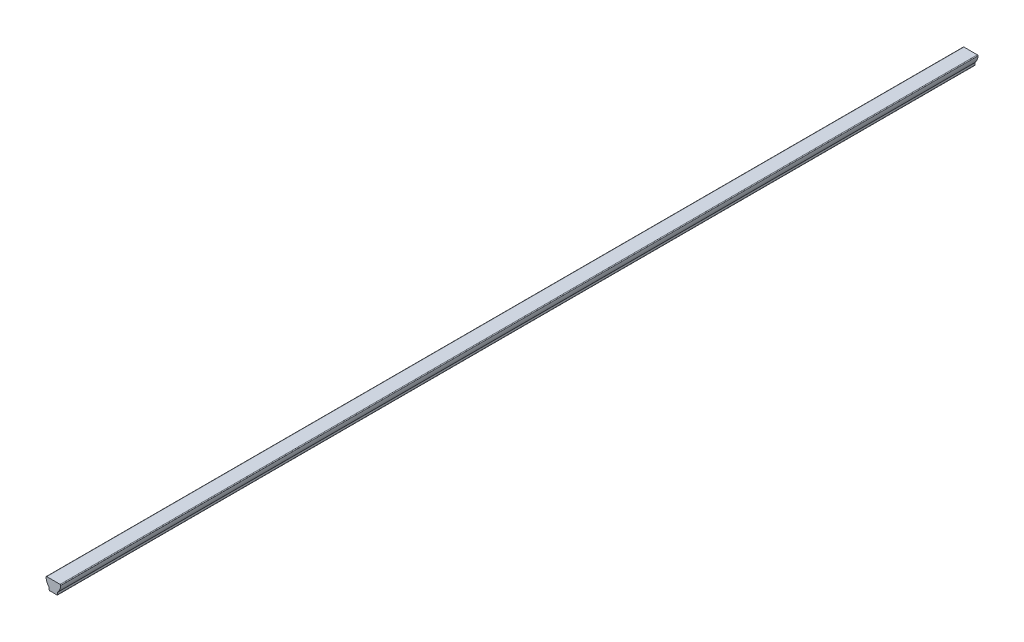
ISO-10303-21;
HEADER;
FILE_DESCRIPTION(('STEP AP214'),'2;1');
FILE_NAME('part.step','',(''),(''),'','','');
FILE_SCHEMA(('AUTOMOTIVE_DESIGN { 1 0 10303 214 1 1 1 1 }'));
ENDSEC;
DATA;
#1=APPLICATION_CONTEXT('core data for automotive mechanical design processes');
#2=APPLICATION_PROTOCOL_DEFINITION('international standard','automotive_design',2000,#1);
#3=PRODUCT_CONTEXT('',#1,'mechanical');
#4=PRODUCT('Part','Part','',(#3));
#5=PRODUCT_RELATED_PRODUCT_CATEGORY('part','',(#4));
#6=PRODUCT_DEFINITION_FORMATION('','',#4);
#7=PRODUCT_DEFINITION_CONTEXT('part definition',#1,'design');
#8=PRODUCT_DEFINITION('design','',#6,#7);
#9=PRODUCT_DEFINITION_SHAPE('','',#8);
#10=(LENGTH_UNIT() NAMED_UNIT(*) SI_UNIT(.MILLI.,.METRE.));
#11=(NAMED_UNIT(*) PLANE_ANGLE_UNIT() SI_UNIT($,.RADIAN.));
#12=(NAMED_UNIT(*) SI_UNIT($,.STERADIAN.) SOLID_ANGLE_UNIT());
#13=UNCERTAINTY_MEASURE_WITH_UNIT(LENGTH_MEASURE(1.E-05),#10,'distance_accuracy_value','');
#14=(GEOMETRIC_REPRESENTATION_CONTEXT(3) GLOBAL_UNCERTAINTY_ASSIGNED_CONTEXT((#13)) GLOBAL_UNIT_ASSIGNED_CONTEXT((#10,
#11,#12)) REPRESENTATION_CONTEXT('',''));
#15=CARTESIAN_POINT('',(0.,0.,0.));
#16=DIRECTION('',(0.,0.,1.));
#17=DIRECTION('',(1.,0.,0.));
#18=AXIS2_PLACEMENT_3D('',#15,#16,#17);
#19=CARTESIAN_POINT('',(-3.70910590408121,5.588,508.));
#20=DIRECTION('',(0.,0.,-1.));
#21=DIRECTION('',(-1.,0.,0.));
#22=AXIS2_PLACEMENT_3D('',#19,#20,#21);
#23=CYLINDRICAL_SURFACE('',#22,0.381);
#24=CARTESIAN_POINT('',(-3.70910590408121,5.588,0.));
#25=DIRECTION('',(0.,0.,1.));
#26=DIRECTION('',(-1.,0.,0.));
#27=AXIS2_PLACEMENT_3D('',#24,#25,#26);
#28=CIRCLE('',#27,0.381);
#29=CARTESIAN_POINT('',(-3.70910590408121,5.969,0.));
#30=VERTEX_POINT('',#29);
#31=CARTESIAN_POINT('',(-4.08935148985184,5.56403555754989,0.));
#32=VERTEX_POINT('',#31);
#33=EDGE_CURVE('E106',#30,#32,#28,.T.);
#34=ORIENTED_EDGE('',*,*,#33,.T.);
#35=DIRECTION('',(0.,0.,-1.));
#36=VECTOR('',#35,1.);
#37=CARTESIAN_POINT('',(-4.08935148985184,5.56403555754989,508.));
#38=LINE('',#37,#36);
#39=CARTESIAN_POINT('',(-4.08935148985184,5.56403555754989,508.));
#40=VERTEX_POINT('',#39);
#41=EDGE_CURVE('E9',#40,#32,#38,.T.);
#42=ORIENTED_EDGE('',*,*,#41,.F.);
#43=CARTESIAN_POINT('',(-3.70910590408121,5.588,508.));
#44=DIRECTION('',(0.,0.,1.));
#45=DIRECTION('',(-1.,0.,0.));
#46=AXIS2_PLACEMENT_3D('',#43,#44,#45);
#47=CIRCLE('',#46,0.381);
#48=CARTESIAN_POINT('',(-3.70910590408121,5.969,508.));
#49=VERTEX_POINT('',#48);
#50=EDGE_CURVE('E141',#49,#40,#47,.T.);
#51=ORIENTED_EDGE('',*,*,#50,.F.);
#52=DIRECTION('',(0.,0.,-1.));
#53=VECTOR('',#52,1.);
#54=CARTESIAN_POINT('',(-3.70910590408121,5.969,508.));
#55=LINE('',#54,#53);
#56=EDGE_CURVE('E119',#49,#30,#55,.T.);
#57=ORIENTED_EDGE('',*,*,#56,.T.);
#58=EDGE_LOOP('',(#34,#42,#51,#57));
#59=FACE_BOUND('',#58,.T.);
#60=ADVANCED_FACE('F14',(#59),#23,.T.);
#61=CARTESIAN_POINT('',(2.33624935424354,5.969,508.));
#62=DIRECTION('',(0.,0.,-1.));
#63=DIRECTION('',(-1.,0.,0.));
#64=AXIS2_PLACEMENT_3D('',#61,#62,#63);
#65=CYLINDRICAL_SURFACE('',#64,6.43834935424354);
#66=CARTESIAN_POINT('',(2.33624935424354,5.969,0.));
#67=DIRECTION('',(0.,0.,1.));
#68=DIRECTION('',(1.,0.,0.));
#69=AXIS2_PLACEMENT_3D('',#66,#67,#68);
#70=CIRCLE('',#69,6.43834935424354);
#71=CARTESIAN_POINT('',(-2.47739463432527,1.69335104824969,0.));
#72=VERTEX_POINT('',#71);
#73=EDGE_CURVE('E102',#32,#72,#70,.T.);
#74=ORIENTED_EDGE('',*,*,#73,.T.);
#75=DIRECTION('',(0.,0.,-1.));
#76=VECTOR('',#75,1.);
#77=CARTESIAN_POINT('',(-2.47739463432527,1.69335104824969,508.));
#78=LINE('',#77,#76);
#79=CARTESIAN_POINT('',(-2.47739463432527,1.69335104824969,508.));
#80=VERTEX_POINT('',#79);
#81=EDGE_CURVE('E21',#80,#72,#78,.T.);
#82=ORIENTED_EDGE('',*,*,#81,.F.);
#83=CARTESIAN_POINT('',(2.33624935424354,5.969,508.));
#84=DIRECTION('',(0.,0.,1.));
#85=DIRECTION('',(1.,0.,0.));
#86=AXIS2_PLACEMENT_3D('',#83,#84,#85);
#87=CIRCLE('',#86,6.43834935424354);
#88=EDGE_CURVE('E115',#40,#80,#87,.T.);
#89=ORIENTED_EDGE('',*,*,#88,.F.);
#90=ORIENTED_EDGE('',*,*,#41,.T.);
#91=EDGE_LOOP('',(#74,#82,#89,#90));
#92=FACE_BOUND('',#91,.T.);
#93=ADVANCED_FACE('F114',(#92),#65,.T.);
#94=CARTESIAN_POINT('',(-2.76225,1.44033243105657,508.));
#95=DIRECTION('',(0.,0.,-1.));
#96=DIRECTION('',(-1.,0.,0.));
#97=AXIS2_PLACEMENT_3D('',#94,#95,#96);
#98=CYLINDRICAL_SURFACE('',#97,0.381);
#99=CARTESIAN_POINT('',(-2.76225,1.44033243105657,0.));
#100=DIRECTION('',(0.,0.,-1.));
#101=DIRECTION('',(-1.,0.,0.));
#102=AXIS2_PLACEMENT_3D('',#99,#100,#101);
#103=CIRCLE('',#102,0.381);
#104=CARTESIAN_POINT('',(-2.38125,1.44033243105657,0.));
#105=VERTEX_POINT('',#104);
#106=EDGE_CURVE('E108',#72,#105,#103,.T.);
#107=ORIENTED_EDGE('',*,*,#106,.T.);
#108=DIRECTION('',(0.,0.,-1.));
#109=VECTOR('',#108,1.);
#110=CARTESIAN_POINT('',(-2.38125,1.44033243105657,508.));
#111=LINE('',#110,#109);
#112=CARTESIAN_POINT('',(-2.38125,1.44033243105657,508.));
#113=VERTEX_POINT('',#112);
#114=EDGE_CURVE('E187',#113,#105,#111,.T.);
#115=ORIENTED_EDGE('',*,*,#114,.F.);
#116=CARTESIAN_POINT('',(-2.76225,1.44033243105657,508.));
#117=DIRECTION('',(0.,0.,-1.));
#118=DIRECTION('',(-1.,0.,0.));
#119=AXIS2_PLACEMENT_3D('',#116,#117,#118);
#120=CIRCLE('',#119,0.381);
#121=EDGE_CURVE('E144',#80,#113,#120,.T.);
#122=ORIENTED_EDGE('',*,*,#121,.F.);
#123=ORIENTED_EDGE('',*,*,#81,.T.);
#124=EDGE_LOOP('',(#107,#115,#122,#123));
#125=FACE_BOUND('',#124,.T.);
#126=ADVANCED_FACE('F191',(#125),#98,.F.);
#127=CARTESIAN_POINT('',(-2.38125,0.381,508.));
#128=DIRECTION('',(1.,0.,0.));
#129=DIRECTION('',(0.,1.,0.));
#130=AXIS2_PLACEMENT_3D('',#127,#128,#129);
#131=PLANE('',#130);
#132=DIRECTION('',(0.,-1.,0.));
#133=VECTOR('',#132,1.);
#134=CARTESIAN_POINT('',(-2.38125,0.381,0.));
#135=LINE('',#134,#133);
#136=CARTESIAN_POINT('',(-2.38125,0.381,0.));
#137=VERTEX_POINT('',#136);
#138=EDGE_CURVE('E123',#105,#137,#135,.T.);
#139=ORIENTED_EDGE('',*,*,#138,.T.);
#140=DIRECTION('',(0.,0.,-1.));
#141=VECTOR('',#140,1.);
#142=CARTESIAN_POINT('',(-2.38125,0.381,508.));
#143=LINE('',#142,#141);
#144=CARTESIAN_POINT('',(-2.38125,0.381,508.));
#145=VERTEX_POINT('',#144);
#146=EDGE_CURVE('E184',#145,#137,#143,.T.);
#147=ORIENTED_EDGE('',*,*,#146,.F.);
#148=DIRECTION('',(0.,-1.,0.));
#149=VECTOR('',#148,1.);
#150=CARTESIAN_POINT('',(-2.38125,0.381,508.));
#151=LINE('',#150,#149);
#152=EDGE_CURVE('E146',#113,#145,#151,.T.);
#153=ORIENTED_EDGE('',*,*,#152,.F.);
#154=ORIENTED_EDGE('',*,*,#114,.T.);
#155=EDGE_LOOP('',(#139,#147,#153,#154));
#156=FACE_BOUND('',#155,.T.);
#157=ADVANCED_FACE('F199',(#156),#131,.F.);
#158=CARTESIAN_POINT('',(-2.00025,0.381,508.));
#159=DIRECTION('',(0.,0.,-1.));
#160=DIRECTION('',(-1.,0.,0.));
#161=AXIS2_PLACEMENT_3D('',#158,#159,#160);
#162=CYLINDRICAL_SURFACE('',#161,0.381);
#163=CARTESIAN_POINT('',(-2.00025,0.381,0.));
#164=DIRECTION('',(0.,0.,1.));
#165=DIRECTION('',(1.,0.,0.));
#166=AXIS2_PLACEMENT_3D('',#163,#164,#165);
#167=CIRCLE('',#166,0.381);
#168=CARTESIAN_POINT('',(-2.00025,0.,0.));
#169=VERTEX_POINT('',#168);
#170=EDGE_CURVE('E125',#137,#169,#167,.T.);
#171=ORIENTED_EDGE('',*,*,#170,.T.);
#172=DIRECTION('',(0.,0.,-1.));
#173=VECTOR('',#172,1.);
#174=CARTESIAN_POINT('',(-2.00025,0.,508.));
#175=LINE('',#174,#173);
#176=CARTESIAN_POINT('',(-2.00025,0.,508.));
#177=VERTEX_POINT('',#176);
#178=EDGE_CURVE('E181',#177,#169,#175,.T.);
#179=ORIENTED_EDGE('',*,*,#178,.F.);
#180=CARTESIAN_POINT('',(-2.00025,0.381,508.));
#181=DIRECTION('',(0.,0.,1.));
#182=DIRECTION('',(1.,0.,0.));
#183=AXIS2_PLACEMENT_3D('',#180,#181,#182);
#184=CIRCLE('',#183,0.381);
#185=EDGE_CURVE('E148',#145,#177,#184,.T.);
#186=ORIENTED_EDGE('',*,*,#185,.F.);
#187=ORIENTED_EDGE('',*,*,#146,.T.);
#188=EDGE_LOOP('',(#171,#179,#186,#187));
#189=FACE_BOUND('',#188,.T.);
#190=ADVANCED_FACE('F202',(#189),#162,.T.);
#191=CARTESIAN_POINT('',(-2.00025,0.,508.));
#192=DIRECTION('',(0.,1.,0.));
#193=DIRECTION('',(0.,0.,1.));
#194=AXIS2_PLACEMENT_3D('',#191,#192,#193);
#195=PLANE('',#194);
#196=DIRECTION('',(1.,0.,0.));
#197=VECTOR('',#196,1.);
#198=CARTESIAN_POINT('',(-2.00025,0.,0.));
#199=LINE('',#198,#197);
#200=CARTESIAN_POINT('',(2.00025,0.,0.));
#201=VERTEX_POINT('',#200);
#202=EDGE_CURVE('E127',#169,#201,#199,.T.);
#203=ORIENTED_EDGE('',*,*,#202,.T.);
#204=DIRECTION('',(0.,0.,-1.));
#205=VECTOR('',#204,1.);
#206=CARTESIAN_POINT('',(2.00025,0.,508.));
#207=LINE('',#206,#205);
#208=CARTESIAN_POINT('',(2.00025,0.,508.));
#209=VERTEX_POINT('',#208);
#210=EDGE_CURVE('E178',#209,#201,#207,.T.);
#211=ORIENTED_EDGE('',*,*,#210,.F.);
#212=DIRECTION('',(1.,0.,0.));
#213=VECTOR('',#212,1.);
#214=CARTESIAN_POINT('',(-2.00025,0.,508.));
#215=LINE('',#214,#213);
#216=EDGE_CURVE('E150',#177,#209,#215,.T.);
#217=ORIENTED_EDGE('',*,*,#216,.F.);
#218=ORIENTED_EDGE('',*,*,#178,.T.);
#219=EDGE_LOOP('',(#203,#211,#217,#218));
#220=FACE_BOUND('',#219,.T.);
#221=ADVANCED_FACE('F207',(#220),#195,.F.);
#222=CARTESIAN_POINT('',(2.00025,0.381,508.));
#223=DIRECTION('',(0.,0.,-1.));
#224=DIRECTION('',(-1.,0.,0.));
#225=AXIS2_PLACEMENT_3D('',#222,#223,#224);
#226=CYLINDRICAL_SURFACE('',#225,0.381);
#227=CARTESIAN_POINT('',(2.00025,0.381,0.));
#228=DIRECTION('',(0.,0.,1.));
#229=DIRECTION('',(1.,0.,0.));
#230=AXIS2_PLACEMENT_3D('',#227,#228,#229);
#231=CIRCLE('',#230,0.381);
#232=CARTESIAN_POINT('',(2.38125,0.381,0.));
#233=VERTEX_POINT('',#232);
#234=EDGE_CURVE('E129',#201,#233,#231,.T.);
#235=ORIENTED_EDGE('',*,*,#234,.T.);
#236=DIRECTION('',(0.,0.,-1.));
#237=VECTOR('',#236,1.);
#238=CARTESIAN_POINT('',(2.38125,0.381,508.));
#239=LINE('',#238,#237);
#240=CARTESIAN_POINT('',(2.38125,0.381,508.));
#241=VERTEX_POINT('',#240);
#242=EDGE_CURVE('E175',#241,#233,#239,.T.);
#243=ORIENTED_EDGE('',*,*,#242,.F.);
#244=CARTESIAN_POINT('',(2.00025,0.381,508.));
#245=DIRECTION('',(0.,0.,1.));
#246=DIRECTION('',(1.,0.,0.));
#247=AXIS2_PLACEMENT_3D('',#244,#245,#246);
#248=CIRCLE('',#247,0.381);
#249=EDGE_CURVE('E152',#209,#241,#248,.T.);
#250=ORIENTED_EDGE('',*,*,#249,.F.);
#251=ORIENTED_EDGE('',*,*,#210,.T.);
#252=EDGE_LOOP('',(#235,#243,#250,#251));
#253=FACE_BOUND('',#252,.T.);
#254=ADVANCED_FACE('F213',(#253),#226,.T.);
#255=CARTESIAN_POINT('',(2.38125,0.381,508.));
#256=DIRECTION('',(-1.,0.,0.));
#257=DIRECTION('',(0.,-1.,0.));
#258=AXIS2_PLACEMENT_3D('',#255,#256,#257);
#259=PLANE('',#258);
#260=DIRECTION('',(0.,1.,0.));
#261=VECTOR('',#260,1.);
#262=CARTESIAN_POINT('',(2.38125,0.381,0.));
#263=LINE('',#262,#261);
#264=CARTESIAN_POINT('',(2.38125,1.44033243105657,0.));
#265=VERTEX_POINT('',#264);
#266=EDGE_CURVE('E131',#233,#265,#263,.T.);
#267=ORIENTED_EDGE('',*,*,#266,.T.);
#268=DIRECTION('',(0.,0.,-1.));
#269=VECTOR('',#268,1.);
#270=CARTESIAN_POINT('',(2.38125,1.44033243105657,508.));
#271=LINE('',#270,#269);
#272=CARTESIAN_POINT('',(2.38125,1.44033243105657,508.));
#273=VERTEX_POINT('',#272);
#274=EDGE_CURVE('E172',#273,#265,#271,.T.);
#275=ORIENTED_EDGE('',*,*,#274,.F.);
#276=DIRECTION('',(0.,1.,0.));
#277=VECTOR('',#276,1.);
#278=CARTESIAN_POINT('',(2.38125,0.381,508.));
#279=LINE('',#278,#277);
#280=EDGE_CURVE('E154',#241,#273,#279,.T.);
#281=ORIENTED_EDGE('',*,*,#280,.F.);
#282=ORIENTED_EDGE('',*,*,#242,.T.);
#283=EDGE_LOOP('',(#267,#275,#281,#282));
#284=FACE_BOUND('',#283,.T.);
#285=ADVANCED_FACE('F217',(#284),#259,.F.);
#286=CARTESIAN_POINT('',(2.76225,1.44033243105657,508.));
#287=DIRECTION('',(0.,0.,-1.));
#288=DIRECTION('',(-1.,0.,0.));
#289=AXIS2_PLACEMENT_3D('',#286,#287,#288);
#290=CYLINDRICAL_SURFACE('',#289,0.381);
#291=CARTESIAN_POINT('',(2.76225,1.44033243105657,0.));
#292=DIRECTION('',(0.,0.,-1.));
#293=DIRECTION('',(-1.,0.,0.));
#294=AXIS2_PLACEMENT_3D('',#291,#292,#293);
#295=CIRCLE('',#294,0.381);
#296=CARTESIAN_POINT('',(2.47739463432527,1.69335104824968,0.));
#297=VERTEX_POINT('',#296);
#298=EDGE_CURVE('E133',#265,#297,#295,.T.);
#299=ORIENTED_EDGE('',*,*,#298,.T.);
#300=DIRECTION('',(0.,0.,-1.));
#301=VECTOR('',#300,1.);
#302=CARTESIAN_POINT('',(2.47739463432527,1.69335104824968,508.));
#303=LINE('',#302,#301);
#304=CARTESIAN_POINT('',(2.47739463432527,1.69335104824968,508.));
#305=VERTEX_POINT('',#304);
#306=EDGE_CURVE('E169',#305,#297,#303,.T.);
#307=ORIENTED_EDGE('',*,*,#306,.F.);
#308=CARTESIAN_POINT('',(2.76225,1.44033243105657,508.));
#309=DIRECTION('',(0.,0.,-1.));
#310=DIRECTION('',(-1.,0.,0.));
#311=AXIS2_PLACEMENT_3D('',#308,#309,#310);
#312=CIRCLE('',#311,0.381);
#313=EDGE_CURVE('E156',#273,#305,#312,.T.);
#314=ORIENTED_EDGE('',*,*,#313,.F.);
#315=ORIENTED_EDGE('',*,*,#274,.T.);
#316=EDGE_LOOP('',(#299,#307,#314,#315));
#317=FACE_BOUND('',#316,.T.);
#318=ADVANCED_FACE('F222',(#317),#290,.F.);
#319=CARTESIAN_POINT('',(-2.33624935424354,5.969,508.));
#320=DIRECTION('',(0.,0.,-1.));
#321=DIRECTION('',(-1.,0.,0.));
#322=AXIS2_PLACEMENT_3D('',#319,#320,#321);
#323=CYLINDRICAL_SURFACE('',#322,6.43834935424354);
#324=CARTESIAN_POINT('',(-2.33624935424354,5.969,0.));
#325=DIRECTION('',(0.,0.,1.));
#326=DIRECTION('',(-1.,0.,0.));
#327=AXIS2_PLACEMENT_3D('',#324,#325,#326);
#328=CIRCLE('',#327,6.43834935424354);
#329=CARTESIAN_POINT('',(4.08935148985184,5.56403555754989,0.));
#330=VERTEX_POINT('',#329);
#331=EDGE_CURVE('E135',#297,#330,#328,.T.);
#332=ORIENTED_EDGE('',*,*,#331,.T.);
#333=DIRECTION('',(0.,0.,-1.));
#334=VECTOR('',#333,1.);
#335=CARTESIAN_POINT('',(4.08935148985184,5.56403555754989,508.));
#336=LINE('',#335,#334);
#337=CARTESIAN_POINT('',(4.08935148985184,5.56403555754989,508.));
#338=VERTEX_POINT('',#337);
#339=EDGE_CURVE('E166',#338,#330,#336,.T.);
#340=ORIENTED_EDGE('',*,*,#339,.F.);
#341=CARTESIAN_POINT('',(-2.33624935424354,5.969,508.));
#342=DIRECTION('',(0.,0.,1.));
#343=DIRECTION('',(-1.,0.,0.));
#344=AXIS2_PLACEMENT_3D('',#341,#342,#343);
#345=CIRCLE('',#344,6.43834935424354);
#346=EDGE_CURVE('E158',#305,#338,#345,.T.);
#347=ORIENTED_EDGE('',*,*,#346,.F.);
#348=ORIENTED_EDGE('',*,*,#306,.T.);
#349=EDGE_LOOP('',(#332,#340,#347,#348));
#350=FACE_BOUND('',#349,.T.);
#351=ADVANCED_FACE('F226',(#350),#323,.T.);
#352=CARTESIAN_POINT('',(3.70910590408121,5.588,508.));
#353=DIRECTION('',(0.,0.,-1.));
#354=DIRECTION('',(-1.,0.,0.));
#355=AXIS2_PLACEMENT_3D('',#352,#353,#354);
#356=CYLINDRICAL_SURFACE('',#355,0.381);
#357=CARTESIAN_POINT('',(3.70910590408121,5.588,0.));
#358=DIRECTION('',(0.,0.,1.));
#359=DIRECTION('',(-1.,0.,0.));
#360=AXIS2_PLACEMENT_3D('',#357,#358,#359);
#361=CIRCLE('',#360,0.381);
#362=CARTESIAN_POINT('',(3.70910590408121,5.969,0.));
#363=VERTEX_POINT('',#362);
#364=EDGE_CURVE('E137',#330,#363,#361,.T.);
#365=ORIENTED_EDGE('',*,*,#364,.T.);
#366=DIRECTION('',(0.,0.,-1.));
#367=VECTOR('',#366,1.);
#368=CARTESIAN_POINT('',(3.70910590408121,5.969,508.));
#369=LINE('',#368,#367);
#370=CARTESIAN_POINT('',(3.70910590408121,5.969,508.));
#371=VERTEX_POINT('',#370);
#372=EDGE_CURVE('E163',#371,#363,#369,.T.);
#373=ORIENTED_EDGE('',*,*,#372,.F.);
#374=CARTESIAN_POINT('',(3.70910590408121,5.588,508.));
#375=DIRECTION('',(0.,0.,1.));
#376=DIRECTION('',(-1.,0.,0.));
#377=AXIS2_PLACEMENT_3D('',#374,#375,#376);
#378=CIRCLE('',#377,0.381);
#379=EDGE_CURVE('E33',#338,#371,#378,.T.);
#380=ORIENTED_EDGE('',*,*,#379,.F.);
#381=ORIENTED_EDGE('',*,*,#339,.T.);
#382=EDGE_LOOP('',(#365,#373,#380,#381));
#383=FACE_BOUND('',#382,.T.);
#384=ADVANCED_FACE('F230',(#383),#356,.T.);
#385=CARTESIAN_POINT('',(-3.70910590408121,5.969,508.));
#386=DIRECTION('',(0.,-1.,0.));
#387=DIRECTION('',(0.,0.,-1.));
#388=AXIS2_PLACEMENT_3D('',#385,#386,#387);
#389=PLANE('',#388);
#390=DIRECTION('',(-1.,0.,0.));
#391=VECTOR('',#390,1.);
#392=CARTESIAN_POINT('',(-3.70910590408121,5.969,0.));
#393=LINE('',#392,#391);
#394=EDGE_CURVE('E139',#363,#30,#393,.T.);
#395=ORIENTED_EDGE('',*,*,#394,.T.);
#396=ORIENTED_EDGE('',*,*,#56,.F.);
#397=DIRECTION('',(-1.,0.,0.));
#398=VECTOR('',#397,1.);
#399=CARTESIAN_POINT('',(-3.70910590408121,5.969,508.));
#400=LINE('',#399,#398);
#401=EDGE_CURVE('E28',#371,#49,#400,.T.);
#402=ORIENTED_EDGE('',*,*,#401,.F.);
#403=ORIENTED_EDGE('',*,*,#372,.T.);
#404=EDGE_LOOP('',(#395,#396,#402,#403));
#405=FACE_BOUND('',#404,.T.);
#406=ADVANCED_FACE('F232',(#405),#389,.F.);
#407=CARTESIAN_POINT('',(-3.70910590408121,5.588,508.));
#408=DIRECTION('',(0.,0.,-1.));
#409=DIRECTION('',(-1.,0.,0.));
#410=AXIS2_PLACEMENT_3D('',#407,#408,#409);
#411=PLANE('',#410);
#412=ORIENTED_EDGE('',*,*,#50,.T.);
#413=ORIENTED_EDGE('',*,*,#88,.T.);
#414=ORIENTED_EDGE('',*,*,#121,.T.);
#415=ORIENTED_EDGE('',*,*,#152,.T.);
#416=ORIENTED_EDGE('',*,*,#185,.T.);
#417=ORIENTED_EDGE('',*,*,#216,.T.);
#418=ORIENTED_EDGE('',*,*,#249,.T.);
#419=ORIENTED_EDGE('',*,*,#280,.T.);
#420=ORIENTED_EDGE('',*,*,#313,.T.);
#421=ORIENTED_EDGE('',*,*,#346,.T.);
#422=ORIENTED_EDGE('',*,*,#379,.T.);
#423=ORIENTED_EDGE('',*,*,#401,.T.);
#424=EDGE_LOOP('',(#412,#413,#414,#415,#416,#417,#418,#419,#420,#421,#422,#423));
#425=FACE_BOUND('',#424,.T.);
#426=ADVANCED_FACE('F194',(#425),#411,.F.);
#427=CARTESIAN_POINT('',(-3.70910590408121,5.588,0.));
#428=DIRECTION('',(0.,0.,-1.));
#429=DIRECTION('',(-1.,0.,0.));
#430=AXIS2_PLACEMENT_3D('',#427,#428,#429);
#431=PLANE('',#430);
#432=ORIENTED_EDGE('',*,*,#33,.F.);
#433=ORIENTED_EDGE('',*,*,#394,.F.);
#434=ORIENTED_EDGE('',*,*,#364,.F.);
#435=ORIENTED_EDGE('',*,*,#331,.F.);
#436=ORIENTED_EDGE('',*,*,#298,.F.);
#437=ORIENTED_EDGE('',*,*,#266,.F.);
#438=ORIENTED_EDGE('',*,*,#234,.F.);
#439=ORIENTED_EDGE('',*,*,#202,.F.);
#440=ORIENTED_EDGE('',*,*,#170,.F.);
#441=ORIENTED_EDGE('',*,*,#138,.F.);
#442=ORIENTED_EDGE('',*,*,#106,.F.);
#443=ORIENTED_EDGE('',*,*,#73,.F.);
#444=EDGE_LOOP('',(#432,#433,#434,#435,#436,#437,#438,#439,#440,#441,#442,#443));
#445=FACE_BOUND('',#444,.T.);
#446=ADVANCED_FACE('F103',(#445),#431,.T.);
#447=CLOSED_SHELL('',(#60,#93,#126,#157,#190,#221,#254,#285,#318,#351,#384,#406,#426,#446));
#448=MANIFOLD_SOLID_BREP('B1',#447);
#449=ADVANCED_BREP_SHAPE_REPRESENTATION('',(#18,#448),#14);
#450=SHAPE_DEFINITION_REPRESENTATION(#9,#449);
ENDSEC;
END-ISO-10303-21;
